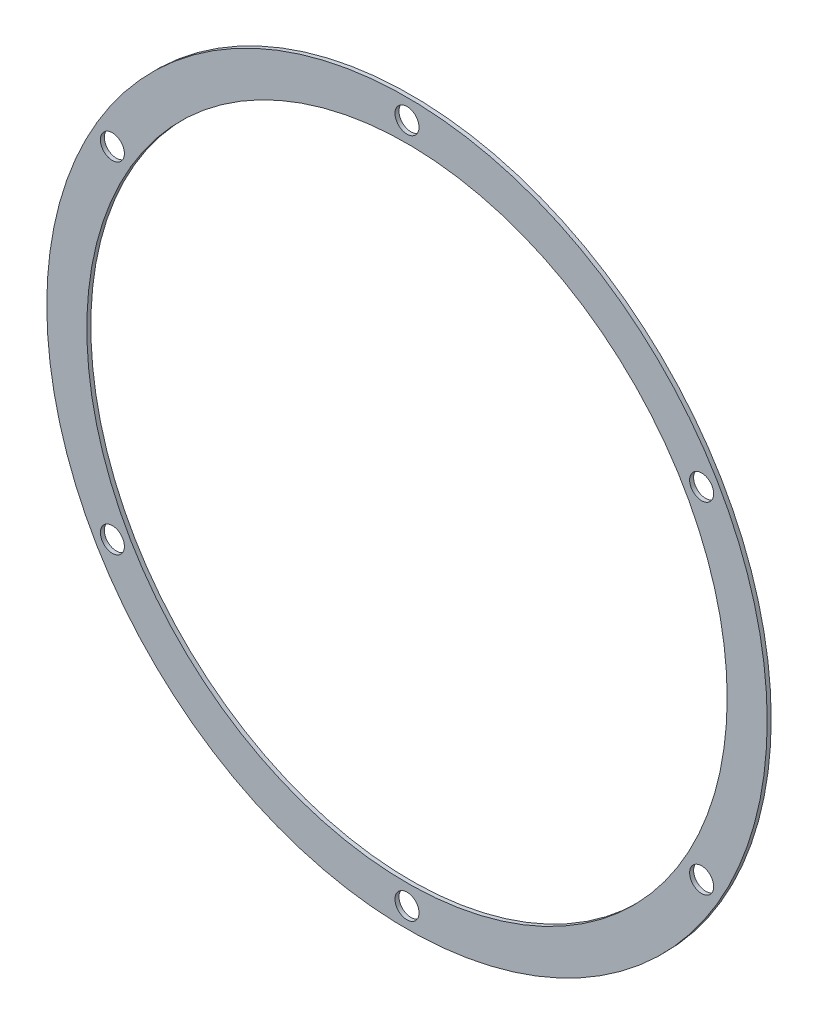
ISO-10303-21;
HEADER;
FILE_DESCRIPTION(('STEP AP214'),'2;1');
FILE_NAME('part.step','',(''),(''),'','','');
FILE_SCHEMA(('AUTOMOTIVE_DESIGN { 1 0 10303 214 1 1 1 1 }'));
ENDSEC;
DATA;
#1=APPLICATION_CONTEXT('core data for automotive mechanical design processes');
#2=APPLICATION_PROTOCOL_DEFINITION('international standard','automotive_design',2000,#1);
#3=PRODUCT_CONTEXT('',#1,'mechanical');
#4=PRODUCT('Part','Part','',(#3));
#5=PRODUCT_RELATED_PRODUCT_CATEGORY('part','',(#4));
#6=PRODUCT_DEFINITION_FORMATION('','',#4);
#7=PRODUCT_DEFINITION_CONTEXT('part definition',#1,'design');
#8=PRODUCT_DEFINITION('design','',#6,#7);
#9=PRODUCT_DEFINITION_SHAPE('','',#8);
#10=(LENGTH_UNIT() NAMED_UNIT(*) SI_UNIT(.MILLI.,.METRE.));
#11=(NAMED_UNIT(*) PLANE_ANGLE_UNIT() SI_UNIT($,.RADIAN.));
#12=(NAMED_UNIT(*) SI_UNIT($,.STERADIAN.) SOLID_ANGLE_UNIT());
#13=UNCERTAINTY_MEASURE_WITH_UNIT(LENGTH_MEASURE(1.E-05),#10,'distance_accuracy_value','');
#14=(GEOMETRIC_REPRESENTATION_CONTEXT(3) GLOBAL_UNCERTAINTY_ASSIGNED_CONTEXT((#13)) GLOBAL_UNIT_ASSIGNED_CONTEXT((#10,
#11,#12)) REPRESENTATION_CONTEXT('',''));
#15=CARTESIAN_POINT('',(0.,0.,0.));
#16=DIRECTION('',(0.,0.,1.));
#17=DIRECTION('',(1.,0.,0.));
#18=AXIS2_PLACEMENT_3D('',#15,#16,#17);
#19=CARTESIAN_POINT('',(0.,0.,2.));
#20=DIRECTION('',(0.,0.,1.));
#21=DIRECTION('',(1.,0.,0.));
#22=AXIS2_PLACEMENT_3D('',#19,#20,#21);
#23=PLANE('',#22);
#24=CARTESIAN_POINT('',(-147.224318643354,-85.0000000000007,2.));
#25=DIRECTION('',(0.,0.,1.));
#26=DIRECTION('',(-0.500000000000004,0.866025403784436,0.));
#27=AXIS2_PLACEMENT_3D('',#24,#25,#26);
#28=CIRCLE('',#27,6.);
#29=CARTESIAN_POINT('',(-150.224318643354,-79.8038475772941,2.));
#30=VERTEX_POINT('',#29);
#31=EDGE_CURVE('E79',#30,#30,#28,.T.);
#32=ORIENTED_EDGE('',*,*,#31,.F.);
#33=EDGE_LOOP('',(#32));
#34=FACE_BOUND('',#33,.T.);
#35=CARTESIAN_POINT('',(0.,-170.,2.));
#36=DIRECTION('',(0.,0.,1.));
#37=DIRECTION('',(-1.,0.,0.));
#38=AXIS2_PLACEMENT_3D('',#35,#36,#37);
#39=CIRCLE('',#38,6.);
#40=CARTESIAN_POINT('',(-6.,-170.,2.));
#41=VERTEX_POINT('',#40);
#42=EDGE_CURVE('E73',#41,#41,#39,.T.);
#43=ORIENTED_EDGE('',*,*,#42,.F.);
#44=EDGE_LOOP('',(#43));
#45=FACE_BOUND('',#44,.T.);
#46=CARTESIAN_POINT('',(147.224318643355,-84.9999999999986,2.));
#47=DIRECTION('',(0.,0.,1.));
#48=DIRECTION('',(-0.499999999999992,-0.866025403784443,0.));
#49=AXIS2_PLACEMENT_3D('',#46,#47,#48);
#50=CIRCLE('',#49,6.);
#51=CARTESIAN_POINT('',(144.224318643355,-90.1961524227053,2.));
#52=VERTEX_POINT('',#51);
#53=EDGE_CURVE('E67',#52,#52,#50,.T.);
#54=ORIENTED_EDGE('',*,*,#53,.F.);
#55=EDGE_LOOP('',(#54));
#56=FACE_BOUND('',#55,.T.);
#57=CARTESIAN_POINT('',(147.224318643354,85.0000000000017,2.));
#58=DIRECTION('',(0.,0.,1.));
#59=DIRECTION('',(0.50000000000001,-0.866025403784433,0.));
#60=AXIS2_PLACEMENT_3D('',#57,#58,#59);
#61=CIRCLE('',#60,6.);
#62=CARTESIAN_POINT('',(150.224318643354,79.8038475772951,2.));
#63=VERTEX_POINT('',#62);
#64=EDGE_CURVE('E61',#63,#63,#61,.T.);
#65=ORIENTED_EDGE('',*,*,#64,.F.);
#66=EDGE_LOOP('',(#65));
#67=FACE_BOUND('',#66,.T.);
#68=CARTESIAN_POINT('',(-147.224318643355,84.9999999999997,2.));
#69=DIRECTION('',(0.,0.,1.));
#70=DIRECTION('',(0.499999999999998,0.86602540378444,0.));
#71=AXIS2_PLACEMENT_3D('',#68,#69,#70);
#72=CIRCLE('',#71,6.);
#73=CARTESIAN_POINT('',(-144.224318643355,90.1961524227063,2.));
#74=VERTEX_POINT('',#73);
#75=EDGE_CURVE('E55',#74,#74,#72,.T.);
#76=ORIENTED_EDGE('',*,*,#75,.F.);
#77=EDGE_LOOP('',(#76));
#78=FACE_BOUND('',#77,.T.);
#79=CARTESIAN_POINT('',(0.,170.,2.));
#80=DIRECTION('',(0.,0.,1.));
#81=DIRECTION('',(1.,0.,0.));
#82=AXIS2_PLACEMENT_3D('',#79,#80,#81);
#83=CIRCLE('',#82,6.);
#84=CARTESIAN_POINT('',(6.,170.,2.));
#85=VERTEX_POINT('',#84);
#86=EDGE_CURVE('E49',#85,#85,#83,.T.);
#87=ORIENTED_EDGE('',*,*,#86,.F.);
#88=EDGE_LOOP('',(#87));
#89=FACE_BOUND('',#88,.T.);
#90=CARTESIAN_POINT('',(0.,0.,2.));
#91=DIRECTION('',(0.,0.,1.));
#92=DIRECTION('',(1.,0.,0.));
#93=AXIS2_PLACEMENT_3D('',#90,#91,#92);
#94=CIRCLE('',#93,180.);
#95=CARTESIAN_POINT('',(180.,0.,2.));
#96=VERTEX_POINT('',#95);
#97=EDGE_CURVE('E10',#96,#96,#94,.T.);
#98=ORIENTED_EDGE('',*,*,#97,.T.);
#99=EDGE_LOOP('',(#98));
#100=FACE_BOUND('',#99,.T.);
#101=CARTESIAN_POINT('',(0.,0.,2.));
#102=DIRECTION('',(0.,0.,1.));
#103=DIRECTION('',(1.,0.,0.));
#104=AXIS2_PLACEMENT_3D('',#101,#102,#103);
#105=CIRCLE('',#104,160.);
#106=CARTESIAN_POINT('',(160.,0.,2.));
#107=VERTEX_POINT('',#106);
#108=EDGE_CURVE('E41',#107,#107,#105,.T.);
#109=ORIENTED_EDGE('',*,*,#108,.F.);
#110=EDGE_LOOP('',(#109));
#111=FACE_BOUND('',#110,.T.);
#112=ADVANCED_FACE('F30',(#34,#45,#56,#67,#78,#89,#100,#111),#23,.T.);
#113=CARTESIAN_POINT('',(0.,0.,0.));
#114=DIRECTION('',(0.,0.,1.));
#115=DIRECTION('',(1.,0.,0.));
#116=AXIS2_PLACEMENT_3D('',#113,#114,#115);
#117=PLANE('',#116);
#118=CARTESIAN_POINT('',(-147.224318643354,-85.0000000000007,0.));
#119=DIRECTION('',(0.,0.,1.));
#120=DIRECTION('',(-0.500000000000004,0.866025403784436,0.));
#121=AXIS2_PLACEMENT_3D('',#118,#119,#120);
#122=CIRCLE('',#121,6.);
#123=CARTESIAN_POINT('',(-150.224318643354,-79.8038475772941,0.));
#124=VERTEX_POINT('',#123);
#125=EDGE_CURVE('E58',#124,#124,#122,.T.);
#126=ORIENTED_EDGE('',*,*,#125,.T.);
#127=EDGE_LOOP('',(#126));
#128=FACE_BOUND('',#127,.T.);
#129=CARTESIAN_POINT('',(0.,-170.,0.));
#130=DIRECTION('',(0.,0.,1.));
#131=DIRECTION('',(-1.,0.,0.));
#132=AXIS2_PLACEMENT_3D('',#129,#130,#131);
#133=CIRCLE('',#132,6.);
#134=CARTESIAN_POINT('',(-6.,-170.,0.));
#135=VERTEX_POINT('',#134);
#136=EDGE_CURVE('E76',#135,#135,#133,.T.);
#137=ORIENTED_EDGE('',*,*,#136,.T.);
#138=EDGE_LOOP('',(#137));
#139=FACE_BOUND('',#138,.T.);
#140=CARTESIAN_POINT('',(147.224318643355,-84.9999999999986,0.));
#141=DIRECTION('',(0.,0.,1.));
#142=DIRECTION('',(-0.499999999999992,-0.866025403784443,0.));
#143=AXIS2_PLACEMENT_3D('',#140,#141,#142);
#144=CIRCLE('',#143,6.);
#145=CARTESIAN_POINT('',(144.224318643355,-90.1961524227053,0.));
#146=VERTEX_POINT('',#145);
#147=EDGE_CURVE('E70',#146,#146,#144,.T.);
#148=ORIENTED_EDGE('',*,*,#147,.T.);
#149=EDGE_LOOP('',(#148));
#150=FACE_BOUND('',#149,.T.);
#151=CARTESIAN_POINT('',(147.224318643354,85.0000000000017,0.));
#152=DIRECTION('',(0.,0.,1.));
#153=DIRECTION('',(0.50000000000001,-0.866025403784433,0.));
#154=AXIS2_PLACEMENT_3D('',#151,#152,#153);
#155=CIRCLE('',#154,6.);
#156=CARTESIAN_POINT('',(150.224318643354,79.8038475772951,0.));
#157=VERTEX_POINT('',#156);
#158=EDGE_CURVE('E64',#157,#157,#155,.T.);
#159=ORIENTED_EDGE('',*,*,#158,.T.);
#160=EDGE_LOOP('',(#159));
#161=FACE_BOUND('',#160,.T.);
#162=CARTESIAN_POINT('',(-147.224318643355,84.9999999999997,0.));
#163=DIRECTION('',(0.,0.,1.));
#164=DIRECTION('',(0.499999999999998,0.86602540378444,0.));
#165=AXIS2_PLACEMENT_3D('',#162,#163,#164);
#166=CIRCLE('',#165,6.);
#167=CARTESIAN_POINT('',(-144.224318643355,90.1961524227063,0.));
#168=VERTEX_POINT('',#167);
#169=EDGE_CURVE('E52',#168,#168,#166,.T.);
#170=ORIENTED_EDGE('',*,*,#169,.T.);
#171=EDGE_LOOP('',(#170));
#172=FACE_BOUND('',#171,.T.);
#173=CARTESIAN_POINT('',(0.,170.,0.));
#174=DIRECTION('',(0.,0.,1.));
#175=DIRECTION('',(1.,0.,0.));
#176=AXIS2_PLACEMENT_3D('',#173,#174,#175);
#177=CIRCLE('',#176,6.);
#178=CARTESIAN_POINT('',(6.,170.,0.));
#179=VERTEX_POINT('',#178);
#180=EDGE_CURVE('E46',#179,#179,#177,.T.);
#181=ORIENTED_EDGE('',*,*,#180,.T.);
#182=EDGE_LOOP('',(#181));
#183=FACE_BOUND('',#182,.T.);
#184=CARTESIAN_POINT('',(0.,0.,0.));
#185=DIRECTION('',(0.,0.,1.));
#186=DIRECTION('',(1.,0.,0.));
#187=AXIS2_PLACEMENT_3D('',#184,#185,#186);
#188=CIRCLE('',#187,180.);
#189=CARTESIAN_POINT('',(180.,0.,0.));
#190=VERTEX_POINT('',#189);
#191=EDGE_CURVE('E34',#190,#190,#188,.T.);
#192=ORIENTED_EDGE('',*,*,#191,.F.);
#193=EDGE_LOOP('',(#192));
#194=FACE_BOUND('',#193,.T.);
#195=CARTESIAN_POINT('',(0.,0.,0.));
#196=DIRECTION('',(0.,0.,1.));
#197=DIRECTION('',(1.,0.,0.));
#198=AXIS2_PLACEMENT_3D('',#195,#196,#197);
#199=CIRCLE('',#198,160.);
#200=CARTESIAN_POINT('',(160.,0.,0.));
#201=VERTEX_POINT('',#200);
#202=EDGE_CURVE('E43',#201,#201,#199,.T.);
#203=ORIENTED_EDGE('',*,*,#202,.T.);
#204=EDGE_LOOP('',(#203));
#205=FACE_BOUND('',#204,.T.);
#206=ADVANCED_FACE('F85',(#128,#139,#150,#161,#172,#183,#194,#205),#117,.F.);
#207=CARTESIAN_POINT('',(0.,0.,2.));
#208=DIRECTION('',(0.,0.,-1.));
#209=DIRECTION('',(-1.,0.,0.));
#210=AXIS2_PLACEMENT_3D('',#207,#208,#209);
#211=CYLINDRICAL_SURFACE('',#210,180.);
#212=ORIENTED_EDGE('',*,*,#97,.F.);
#213=EDGE_LOOP('',(#212));
#214=FACE_BOUND('',#213,.T.);
#215=ORIENTED_EDGE('',*,*,#191,.T.);
#216=EDGE_LOOP('',(#215));
#217=FACE_BOUND('',#216,.T.);
#218=ADVANCED_FACE('F32',(#214,#217),#211,.T.);
#219=CARTESIAN_POINT('',(0.,0.,2.));
#220=DIRECTION('',(0.,0.,-1.));
#221=DIRECTION('',(-1.,0.,0.));
#222=AXIS2_PLACEMENT_3D('',#219,#220,#221);
#223=CYLINDRICAL_SURFACE('',#222,160.);
#224=ORIENTED_EDGE('',*,*,#108,.T.);
#225=EDGE_LOOP('',(#224));
#226=FACE_BOUND('',#225,.T.);
#227=ORIENTED_EDGE('',*,*,#202,.F.);
#228=EDGE_LOOP('',(#227));
#229=FACE_BOUND('',#228,.T.);
#230=ADVANCED_FACE('F110',(#226,#229),#223,.F.);
#231=CARTESIAN_POINT('',(0.,170.,0.));
#232=DIRECTION('',(0.,0.,1.));
#233=DIRECTION('',(1.,0.,0.));
#234=AXIS2_PLACEMENT_3D('',#231,#232,#233);
#235=CYLINDRICAL_SURFACE('',#234,6.);
#236=ORIENTED_EDGE('',*,*,#180,.F.);
#237=EDGE_LOOP('',(#236));
#238=FACE_BOUND('',#237,.T.);
#239=ORIENTED_EDGE('',*,*,#86,.T.);
#240=EDGE_LOOP('',(#239));
#241=FACE_BOUND('',#240,.T.);
#242=ADVANCED_FACE('F113',(#238,#241),#235,.F.);
#243=CARTESIAN_POINT('',(-147.224318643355,84.9999999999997,0.));
#244=DIRECTION('',(0.,0.,1.));
#245=DIRECTION('',(1.,0.,0.));
#246=AXIS2_PLACEMENT_3D('',#243,#244,#245);
#247=CYLINDRICAL_SURFACE('',#246,6.);
#248=ORIENTED_EDGE('',*,*,#169,.F.);
#249=EDGE_LOOP('',(#248));
#250=FACE_BOUND('',#249,.T.);
#251=ORIENTED_EDGE('',*,*,#75,.T.);
#252=EDGE_LOOP('',(#251));
#253=FACE_BOUND('',#252,.T.);
#254=ADVANCED_FACE('F125',(#250,#253),#247,.F.);
#255=CARTESIAN_POINT('',(147.224318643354,85.0000000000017,0.));
#256=DIRECTION('',(0.,0.,1.));
#257=DIRECTION('',(1.,0.,0.));
#258=AXIS2_PLACEMENT_3D('',#255,#256,#257);
#259=CYLINDRICAL_SURFACE('',#258,6.);
#260=ORIENTED_EDGE('',*,*,#158,.F.);
#261=EDGE_LOOP('',(#260));
#262=FACE_BOUND('',#261,.T.);
#263=ORIENTED_EDGE('',*,*,#64,.T.);
#264=EDGE_LOOP('',(#263));
#265=FACE_BOUND('',#264,.T.);
#266=ADVANCED_FACE('F129',(#262,#265),#259,.F.);
#267=CARTESIAN_POINT('',(147.224318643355,-84.9999999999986,0.));
#268=DIRECTION('',(0.,0.,1.));
#269=DIRECTION('',(1.,0.,0.));
#270=AXIS2_PLACEMENT_3D('',#267,#268,#269);
#271=CYLINDRICAL_SURFACE('',#270,6.);
#272=ORIENTED_EDGE('',*,*,#147,.F.);
#273=EDGE_LOOP('',(#272));
#274=FACE_BOUND('',#273,.T.);
#275=ORIENTED_EDGE('',*,*,#53,.T.);
#276=EDGE_LOOP('',(#275));
#277=FACE_BOUND('',#276,.T.);
#278=ADVANCED_FACE('F133',(#274,#277),#271,.F.);
#279=CARTESIAN_POINT('',(0.,-170.,0.));
#280=DIRECTION('',(0.,0.,1.));
#281=DIRECTION('',(1.,0.,0.));
#282=AXIS2_PLACEMENT_3D('',#279,#280,#281);
#283=CYLINDRICAL_SURFACE('',#282,6.);
#284=ORIENTED_EDGE('',*,*,#136,.F.);
#285=EDGE_LOOP('',(#284));
#286=FACE_BOUND('',#285,.T.);
#287=ORIENTED_EDGE('',*,*,#42,.T.);
#288=EDGE_LOOP('',(#287));
#289=FACE_BOUND('',#288,.T.);
#290=ADVANCED_FACE('F91',(#286,#289),#283,.F.);
#291=CARTESIAN_POINT('',(-147.224318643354,-85.0000000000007,0.));
#292=DIRECTION('',(0.,0.,1.));
#293=DIRECTION('',(1.,0.,0.));
#294=AXIS2_PLACEMENT_3D('',#291,#292,#293);
#295=CYLINDRICAL_SURFACE('',#294,6.);
#296=ORIENTED_EDGE('',*,*,#125,.F.);
#297=EDGE_LOOP('',(#296));
#298=FACE_BOUND('',#297,.T.);
#299=ORIENTED_EDGE('',*,*,#31,.T.);
#300=EDGE_LOOP('',(#299));
#301=FACE_BOUND('',#300,.T.);
#302=ADVANCED_FACE('F88',(#298,#301),#295,.F.);
#303=CLOSED_SHELL('',(#112,#206,#218,#230,#242,#254,#266,#278,#290,#302));
#304=MANIFOLD_SOLID_BREP('B2',#303);
#305=ADVANCED_BREP_SHAPE_REPRESENTATION('',(#18,#304),#14);
#306=SHAPE_DEFINITION_REPRESENTATION(#9,#305);
ENDSEC;
END-ISO-10303-21;
